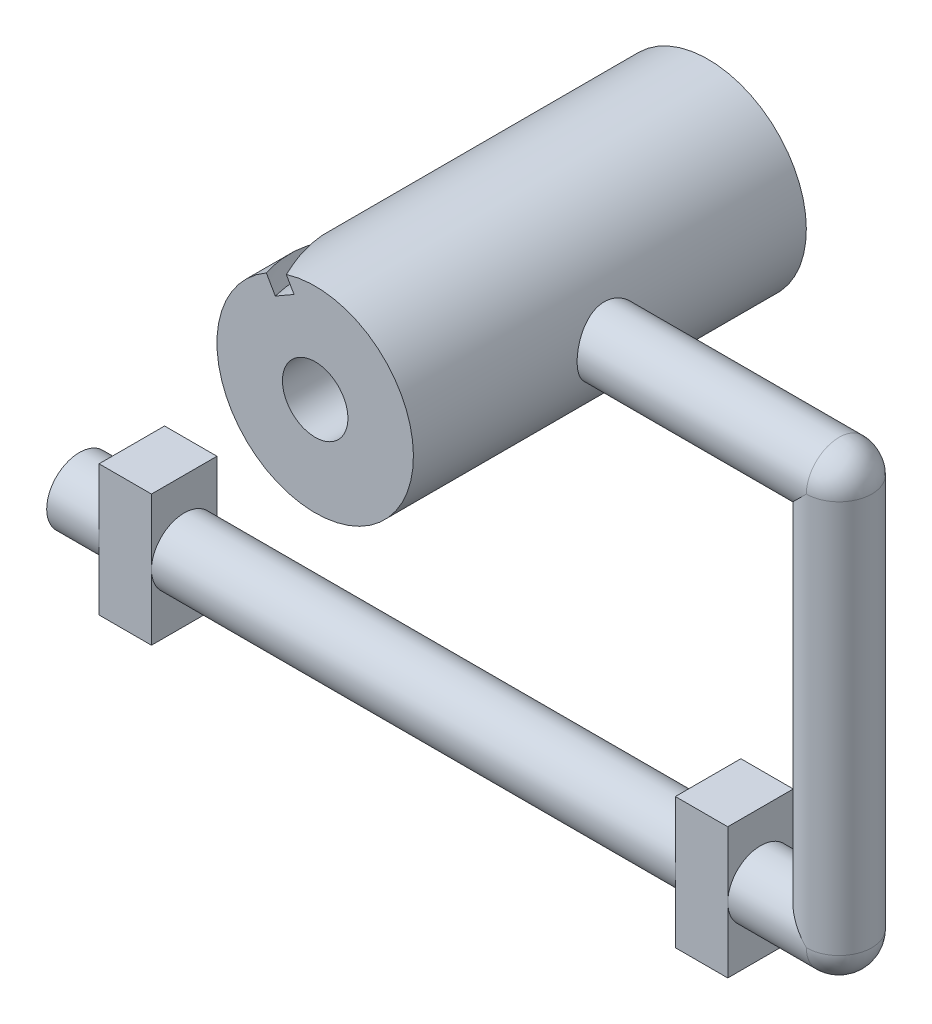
ISO-10303-21;
HEADER;
FILE_DESCRIPTION(('STEP AP214'),'2;1');
FILE_NAME('part.step','',(''),(''),'','','');
FILE_SCHEMA(('AUTOMOTIVE_DESIGN { 1 0 10303 214 1 1 1 1 }'));
ENDSEC;
DATA;
#1=APPLICATION_CONTEXT('core data for automotive mechanical design processes');
#2=APPLICATION_PROTOCOL_DEFINITION('international standard','automotive_design',2000,#1);
#3=PRODUCT_CONTEXT('',#1,'mechanical');
#4=PRODUCT('Part','Part','',(#3));
#5=PRODUCT_RELATED_PRODUCT_CATEGORY('part','',(#4));
#6=PRODUCT_DEFINITION_FORMATION('','',#4);
#7=PRODUCT_DEFINITION_CONTEXT('part definition',#1,'design');
#8=PRODUCT_DEFINITION('design','',#6,#7);
#9=PRODUCT_DEFINITION_SHAPE('','',#8);
#10=(LENGTH_UNIT() NAMED_UNIT(*) SI_UNIT(.MILLI.,.METRE.));
#11=(NAMED_UNIT(*) PLANE_ANGLE_UNIT() SI_UNIT($,.RADIAN.));
#12=(NAMED_UNIT(*) SI_UNIT($,.STERADIAN.) SOLID_ANGLE_UNIT());
#13=UNCERTAINTY_MEASURE_WITH_UNIT(LENGTH_MEASURE(1.E-05),#10,'distance_accuracy_value','');
#14=(GEOMETRIC_REPRESENTATION_CONTEXT(3) GLOBAL_UNCERTAINTY_ASSIGNED_CONTEXT((#13)) GLOBAL_UNIT_ASSIGNED_CONTEXT((#10,
#11,#12)) REPRESENTATION_CONTEXT('',''));
#15=CARTESIAN_POINT('',(0.,0.,0.));
#16=DIRECTION('',(0.,0.,1.));
#17=DIRECTION('',(1.,0.,0.));
#18=AXIS2_PLACEMENT_3D('',#15,#16,#17);
#19=CARTESIAN_POINT('',(0.,0.,15.));
#20=DIRECTION('',(0.,0.,-1.));
#21=DIRECTION('',(-1.,0.,0.));
#22=AXIS2_PLACEMENT_3D('',#19,#20,#21);
#23=CYLINDRICAL_SURFACE('',#22,7.5);
#24=CARTESIAN_POINT('',(7.5,0.,2.5));
#25=CARTESIAN_POINT('',(7.5000003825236,-0.136408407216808,2.5000006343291));
#26=CARTESIAN_POINT('',(7.49624423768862,-0.272812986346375,2.48879933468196));
#27=CARTESIAN_POINT('',(7.48163025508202,-0.54160440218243,2.44442722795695));
#28=CARTESIAN_POINT('',(7.47077168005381,-0.673990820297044,2.41125414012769));
#29=CARTESIAN_POINT('',(7.44313269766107,-0.93083197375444,2.32420189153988));
#30=CARTESIAN_POINT('',(7.42636219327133,-1.05529956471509,2.27035734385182));
#31=CARTESIAN_POINT('',(7.38861114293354,-1.29343734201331,2.14364706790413));
#32=CARTESIAN_POINT('',(7.36762976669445,-1.40710539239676,2.0707775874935));
#33=CARTESIAN_POINT('',(7.32285236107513,-1.62435418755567,1.90543548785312));
#34=CARTESIAN_POINT('',(7.29898891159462,-1.72750925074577,1.81242191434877));
#35=CARTESIAN_POINT('',(7.25150786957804,-1.91708173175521,1.61058211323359));
#36=CARTESIAN_POINT('',(7.22789033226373,-2.00349546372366,1.50175241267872));
#37=CARTESIAN_POINT('',(7.18283331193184,-2.15956235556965,1.26753721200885));
#38=CARTESIAN_POINT('',(7.1614759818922,-2.22866214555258,1.14176565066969));
#39=CARTESIAN_POINT('',(7.12438263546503,-2.3445471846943,0.879559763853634));
#40=CARTESIAN_POINT('',(7.10864490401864,-2.39133924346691,0.743128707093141));
#41=CARTESIAN_POINT('',(7.08528258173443,-2.45968365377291,0.468316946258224));
#42=CARTESIAN_POINT('',(7.07740239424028,-2.48203362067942,0.330156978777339));
#43=CARTESIAN_POINT('',(7.06989141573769,-2.50335280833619,0.0518406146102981));
#44=CARTESIAN_POINT('',(7.07025807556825,-2.5023292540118,-0.0883151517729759));
#45=CARTESIAN_POINT('',(7.0789753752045,-2.47754975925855,-0.359841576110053));
#46=CARTESIAN_POINT('',(7.08696039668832,-2.45483478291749,-0.491321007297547));
#47=CARTESIAN_POINT('',(7.10941644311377,-2.38901540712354,-0.748483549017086));
#48=CARTESIAN_POINT('',(7.12388824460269,-2.34590856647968,-0.874165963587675));
#49=CARTESIAN_POINT('',(7.15794777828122,-2.23984764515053,-1.1185318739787));
#50=CARTESIAN_POINT('',(7.17761414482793,-2.17658512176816,-1.23707006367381));
#51=CARTESIAN_POINT('',(7.21981396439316,-2.03222276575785,-1.46217727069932));
#52=CARTESIAN_POINT('',(7.24234824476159,-1.95111778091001,-1.56874281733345));
#53=CARTESIAN_POINT('',(7.28918322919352,-1.76837333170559,-1.77272899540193));
#54=CARTESIAN_POINT('',(7.31351473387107,-1.66588287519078,-1.86938173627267));
#55=CARTESIAN_POINT('',(7.36017345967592,-1.44584892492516,-2.04432816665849));
#56=CARTESIAN_POINT('',(7.38250048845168,-1.32830398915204,-2.12262009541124));
#57=CARTESIAN_POINT('',(7.42292769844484,-1.07986903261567,-2.25924075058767));
#58=CARTESIAN_POINT('',(7.44098375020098,-0.948858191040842,-2.31736372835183));
#59=CARTESIAN_POINT('',(7.47051417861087,-0.678172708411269,-2.41050793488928));
#60=CARTESIAN_POINT('',(7.48199084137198,-0.538501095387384,-2.44553718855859));
#61=CARTESIAN_POINT('',(7.49669067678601,-0.26095957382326,-2.4901391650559));
#62=CARTESIAN_POINT('',(7.5002500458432,-0.123273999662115,-2.50074952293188));
#63=CARTESIAN_POINT('',(7.49972256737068,0.151937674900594,-2.49916831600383));
#64=CARTESIAN_POINT('',(7.49563701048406,0.289463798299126,-2.48698060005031));
#65=CARTESIAN_POINT('',(7.48050061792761,0.556299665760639,-2.4409702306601));
#66=CARTESIAN_POINT('',(7.46965496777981,0.685732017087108,-2.40778448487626));
#67=CARTESIAN_POINT('',(7.44229617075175,0.937139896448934,-2.32151638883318));
#68=CARTESIAN_POINT('',(7.42578230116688,1.05911447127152,-2.26843150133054));
#69=CARTESIAN_POINT('',(7.38822328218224,1.29572074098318,-2.14232392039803));
#70=CARTESIAN_POINT('',(7.36707036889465,1.41007489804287,-2.06881351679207));
#71=CARTESIAN_POINT('',(7.32263134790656,1.62516207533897,-1.90451462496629));
#72=CARTESIAN_POINT('',(7.29934458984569,1.72589091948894,-1.81372085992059));
#73=CARTESIAN_POINT('',(7.25192119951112,1.91563126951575,-1.61255312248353));
#74=CARTESIAN_POINT('',(7.2277940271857,2.00390242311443,-1.50147693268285));
#75=CARTESIAN_POINT('',(7.18249933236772,2.16064380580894,-1.26557108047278));
#76=CARTESIAN_POINT('',(7.16133183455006,2.22911386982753,-1.14074130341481));
#77=CARTESIAN_POINT('',(7.12455979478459,2.3439923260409,-0.880817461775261));
#78=CARTESIAN_POINT('',(7.10894401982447,2.39044533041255,-0.745744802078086));
#79=CARTESIAN_POINT('',(7.08527080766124,2.45973666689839,-0.469053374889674));
#80=CARTESIAN_POINT('',(7.07720996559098,2.48258563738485,-0.327437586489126));
#81=CARTESIAN_POINT('',(7.06994647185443,2.50319070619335,-0.0495072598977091));
#82=CARTESIAN_POINT('',(7.07031000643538,2.502175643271,0.0867058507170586));
#83=CARTESIAN_POINT('',(7.07878174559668,2.47810573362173,0.356912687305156));
#84=CARTESIAN_POINT('',(7.08688948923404,2.45505219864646,0.490906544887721));
#85=CARTESIAN_POINT('',(7.10961310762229,2.38842953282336,0.75033915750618));
#86=CARTESIAN_POINT('',(7.12410245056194,2.34525836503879,0.875892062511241));
#87=CARTESIAN_POINT('',(7.15790997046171,2.23994841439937,1.11806851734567));
#88=CARTESIAN_POINT('',(7.17722921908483,2.17780542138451,1.23469007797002));
#89=CARTESIAN_POINT('',(7.21957073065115,2.03315173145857,1.46120917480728));
#90=CARTESIAN_POINT('',(7.24271779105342,1.94987060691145,1.57059125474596));
#91=CARTESIAN_POINT('',(7.28958390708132,1.76660720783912,1.7742245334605));
#92=CARTESIAN_POINT('',(7.31330312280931,1.6666202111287,1.86847143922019));
#93=CARTESIAN_POINT('',(7.3597507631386,1.44810389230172,2.04286103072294));
#94=CARTESIAN_POINT('',(7.38240454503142,1.32900378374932,2.1223108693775));
#95=CARTESIAN_POINT('',(7.4231497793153,1.07839339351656,2.25997607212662));
#96=CARTESIAN_POINT('',(7.44124239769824,0.946886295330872,2.31819686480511));
#97=CARTESIAN_POINT('',(7.47013787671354,0.68123411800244,2.40930408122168));
#98=CARTESIAN_POINT('',(7.48123031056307,0.547469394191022,2.44320616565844));
#99=CARTESIAN_POINT('',(7.49616017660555,0.275801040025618,2.48855070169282));
#100=CARTESIAN_POINT('',(7.49999961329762,0.137898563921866,2.49999935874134));
#101=CARTESIAN_POINT('',(7.5,0.,2.5));
#102=B_SPLINE_CURVE_WITH_KNOTS('',3,(#24,#25,#26,#27,#28,#29,#30,#31,#32,#33,#34,#35,#36,#37,
#38,#39,#40,#41,#42,#43,#44,#45,#46,#47,#48,#49,#50,#51,#52,#53,#54,#55,#56,#57,#58,#59,#60,#61,
#62,#63,#64,#65,#66,#67,#68,#69,#70,#71,#72,#73,#74,#75,#76,#77,#78,#79,#80,#81,#82,#83,#84,#85,
#86,#87,#88,#89,#90,#91,#92,#93,#94,#95,#96,#97,#98,#99,#100,#101),.UNSPECIFIED.,.T.,.F.,(4,2,2,
2,2,2,2,2,2,2,2,2,2,2,2,2,2,2,2,2,2,2,2,2,2,2,2,2,2,2,2,2,2,2,2,2,2,2,4),(0.,0.408717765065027,
0.817477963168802,1.22555668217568,1.63371594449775,2.0546171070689,2.47561083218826,
2.90870962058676,3.34167611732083,3.760048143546,4.17829084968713,4.57742066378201,
4.97659827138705,5.38220427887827,5.78792756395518,6.21483264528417,6.64177864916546,
7.07296014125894,7.50399172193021,7.91633957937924,8.32861782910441,8.72895394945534,
9.1293411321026,9.54025999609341,9.95130452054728,10.3810255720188,10.8107502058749,
11.2396003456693,11.668257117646,12.0748916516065,12.4815019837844,12.8803896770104,
13.2793659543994,13.6957516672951,14.1122552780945,14.5449915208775,14.9776170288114,
15.3909139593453,15.8040966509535),.UNSPECIFIED.);
#103=CARTESIAN_POINT('',(7.5,0.,2.5));
#104=VERTEX_POINT('',#103);
#105=EDGE_CURVE('E317',#104,#104,#102,.T.);
#106=ORIENTED_EDGE('',*,*,#105,.F.);
#107=EDGE_LOOP('',(#106));
#108=FACE_BOUND('',#107,.T.);
#109=CARTESIAN_POINT('',(-2.06728016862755,-7.20946271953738,-15.));
#110=CARTESIAN_POINT('',(-3.71279298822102,-6.73761951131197,-12.125));
#111=CARTESIAN_POINT('',(-4.990623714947,-5.59854221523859,-9.25000000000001));
#112=CARTESIAN_POINT('',(-6.26845444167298,-4.45946491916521,-6.37500000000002));
#113=CARTESIAN_POINT('',(-6.92551302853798,-2.87876176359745,-3.50000000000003));
#114=CARTESIAN_POINT('',(-7.58257161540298,-1.29805860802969,-0.625000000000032));
#115=CARTESIAN_POINT('',(-7.48871955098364,0.411192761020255,2.24999999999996));
#116=CARTESIAN_POINT('',(-7.39486748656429,2.1204441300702,5.12499999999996));
#117=CARTESIAN_POINT('',(-6.5686933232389,3.61970551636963,7.99999999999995));
#118=CARTESIAN_POINT('',(-5.7425191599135,5.11896690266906,10.8749999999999));
#119=CARTESIAN_POINT('',(-4.34765682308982,6.11129120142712,13.7499999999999));
#120=CARTESIAN_POINT('',(-2.95279448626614,7.10361550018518,16.6249999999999));
#121=CARTESIAN_POINT('',(-1.26551356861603,7.39246071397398,19.4999999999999));
#122=CARTESIAN_POINT('',(0.421767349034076,7.68130592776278,22.3749999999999));
#123=CARTESIAN_POINT('',(2.06728016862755,7.20946271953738,25.2499999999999));
#124=CARTESIAN_POINT('',(3.71279298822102,6.73761951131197,28.1249999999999));
#125=CARTESIAN_POINT('',(4.990623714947,5.59854221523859,30.9999999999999));
#126=(BOUNDED_CURVE() B_SPLINE_CURVE(2,(#109,#110,#111,#112,#113,#114,#115,#116,#117,#118,#119,
#120,#121,#122,#123,#124,#125),.UNSPECIFIED.,.F.,.F.) B_SPLINE_CURVE_WITH_KNOTS((3,2,2,2,2,2,2,
2,3),(0.,0.125,0.25,0.375,0.5,0.625,0.75,0.875,1.),
.UNSPECIFIED.) CURVE() GEOMETRIC_REPRESENTATION_ITEM() RATIONAL_B_SPLINE_CURVE((1.,
0.974927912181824,1.,0.974927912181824,1.,0.974927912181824,1.,0.974927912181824,1.,
0.974927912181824,1.,0.974927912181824,1.,0.974927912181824,1.,0.974927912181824,1.)) REPRESENTATION_ITEM(''));
#127=CARTESIAN_POINT('',(-2.06728016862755,-7.20946271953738,-15.));
#128=VERTEX_POINT('',#127);
#129=CARTESIAN_POINT('',(-3.72694224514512,6.50844847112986,15.));
#130=VERTEX_POINT('',#129);
#131=EDGE_CURVE('E185',#128,#130,#126,.T.);
#132=ORIENTED_EDGE('',*,*,#131,.F.);
#133=CARTESIAN_POINT('',(0.,0.,-15.));
#134=DIRECTION('',(0.,0.,1.));
#135=DIRECTION('',(1.,0.,0.));
#136=AXIS2_PLACEMENT_3D('',#133,#134,#135);
#137=CIRCLE('',#136,7.5);
#138=CARTESIAN_POINT('',(-3.60148470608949,-6.57870108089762,-15.));
#139=VERTEX_POINT('',#138);
#140=EDGE_CURVE('E332',#128,#139,#137,.T.);
#141=ORIENTED_EDGE('',*,*,#140,.T.);
#142=CARTESIAN_POINT('',(-3.60148470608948,-6.57870108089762,-15.));
#143=CARTESIAN_POINT('',(-5.10303029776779,-5.75668569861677,-12.125));
#144=CARTESIAN_POINT('',(-6.0992170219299,-4.36457921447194,-9.25000000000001));
#145=CARTESIAN_POINT('',(-7.095403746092,-2.97247273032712,-6.37500000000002));
#146=CARTESIAN_POINT('',(-7.38892460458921,-1.28599890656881,-3.50000000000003));
#147=CARTESIAN_POINT('',(-7.68244546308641,0.400474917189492,-0.625000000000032));
#148=CARTESIAN_POINT('',(-7.21516505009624,2.04728925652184,2.24999999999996));
#149=CARTESIAN_POINT('',(-6.74788463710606,3.69410359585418,5.12499999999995));
#150=CARTESIAN_POINT('',(-5.61235356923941,4.97508667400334,7.99999999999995));
#151=CARTESIAN_POINT('',(-4.47682250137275,6.2560697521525,10.8749999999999));
#152=CARTESIAN_POINT('',(-2.89794663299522,6.91750716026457,13.7499999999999));
#153=CARTESIAN_POINT('',(-1.3190707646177,7.57894456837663,16.6249999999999));
#154=CARTESIAN_POINT('',(0.390434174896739,7.48983051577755,19.4999999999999));
#155=CARTESIAN_POINT('',(2.09993911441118,7.40071646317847,22.3749999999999));
#156=CARTESIAN_POINT('',(3.60148470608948,6.57870108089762,25.2499999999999));
#157=CARTESIAN_POINT('',(5.10303029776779,5.75668569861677,28.1249999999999));
#158=CARTESIAN_POINT('',(6.0992170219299,4.36457921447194,30.9999999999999));
#159=(BOUNDED_CURVE() B_SPLINE_CURVE(2,(#142,#143,#144,#145,#146,#147,#148,#149,#150,#151,#152,
#153,#154,#155,#156,#157,#158),.UNSPECIFIED.,.F.,.F.) B_SPLINE_CURVE_WITH_KNOTS((3,2,2,2,2,2,2,
2,3),(0.,0.125,0.25,0.375,0.5,0.625,0.75,0.875,1.),
.UNSPECIFIED.) CURVE() GEOMETRIC_REPRESENTATION_ITEM() RATIONAL_B_SPLINE_CURVE((1.,
0.974927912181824,1.,0.974927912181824,1.,0.974927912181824,1.,0.974927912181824,1.,
0.974927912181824,1.,0.974927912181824,1.,0.974927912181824,1.,0.974927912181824,1.)) REPRESENTATION_ITEM(''));
#160=CARTESIAN_POINT('',(-2.20511190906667,7.16850622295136,15.));
#161=VERTEX_POINT('',#160);
#162=EDGE_CURVE('E162',#161,#139,#159,.F.);
#163=ORIENTED_EDGE('',*,*,#162,.F.);
#164=CARTESIAN_POINT('',(0.,0.,15.));
#165=DIRECTION('',(0.,0.,1.));
#166=DIRECTION('',(1.,0.,0.));
#167=AXIS2_PLACEMENT_3D('',#164,#165,#166);
#168=CIRCLE('',#167,7.5);
#169=EDGE_CURVE('E324',#130,#161,#168,.T.);
#170=ORIENTED_EDGE('',*,*,#169,.F.);
#171=EDGE_LOOP('',(#132,#141,#163,#170));
#172=FACE_BOUND('',#171,.T.);
#173=ADVANCED_FACE('F32',(#108,#172),#23,.T.);
#174=CARTESIAN_POINT('',(0.,0.,15.));
#175=DIRECTION('',(0.,0.,1.));
#176=DIRECTION('',(1.,0.,0.));
#177=AXIS2_PLACEMENT_3D('',#174,#175,#176);
#178=PLANE('',#177);
#179=CARTESIAN_POINT('',(0.,0.,15.));
#180=DIRECTION('',(0.,0.,1.));
#181=DIRECTION('',(1.,0.,0.));
#182=AXIS2_PLACEMENT_3D('',#179,#180,#181);
#183=CIRCLE('',#182,2.5);
#184=CARTESIAN_POINT('',(2.5,0.,15.));
#185=VERTEX_POINT('',#184);
#186=EDGE_CURVE('E331',#185,#185,#183,.T.);
#187=ORIENTED_EDGE('',*,*,#186,.F.);
#188=EDGE_LOOP('',(#187));
#189=FACE_BOUND('',#188,.T.);
#190=CARTESIAN_POINT('',(-1.61515304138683,6.13824692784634,15.));
#191=CARTESIAN_POINT('',(-1.73744181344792,6.06822053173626,15.));
#192=CARTESIAN_POINT('',(-1.85973058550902,5.99819413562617,15.));
#193=CARTESIAN_POINT('',(-2.10430812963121,5.85814134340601,15.));
#194=CARTESIAN_POINT('',(-2.2265969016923,5.78811494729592,15.));
#195=CARTESIAN_POINT('',(-2.58119907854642,5.58505859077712,15.));
#196=CARTESIAN_POINT('',(-2.81351248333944,5.4520286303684,15.));
#197=CARTESIAN_POINT('',(-3.04582588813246,5.31899866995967,15.));
#198=B_SPLINE_CURVE_WITH_KNOTS('',3,(#190,#191,#192,#193,#194,#195,#196,#197),.UNSPECIFIED.,.F.,
.F.,(4,2,2,4),(0.,0.422757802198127,0.845515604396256,1.6486335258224),.UNSPECIFIED.);
#199=CARTESIAN_POINT('',(-1.61515304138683,6.13824692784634,15.));
#200=VERTEX_POINT('',#199);
#201=CARTESIAN_POINT('',(-3.04582588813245,5.31899866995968,15.));
#202=VERTEX_POINT('',#201);
#203=EDGE_CURVE('E43',#200,#202,#198,.T.);
#204=ORIENTED_EDGE('',*,*,#203,.T.);
#205=CARTESIAN_POINT('',(-3.04582588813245,5.31899866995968,15.));
#206=CARTESIAN_POINT('',(-3.10404526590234,5.42066856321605,15.));
#207=CARTESIAN_POINT('',(-3.16226464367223,5.52233845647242,15.));
#208=CARTESIAN_POINT('',(-3.27870339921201,5.72567824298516,15.));
#209=CARTESIAN_POINT('',(-3.3369227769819,5.82734813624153,15.));
#210=CARTESIAN_POINT('',(-3.5057421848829,6.12216151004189,15.));
#211=CARTESIAN_POINT('',(-3.61634221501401,6.31530499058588,15.));
#212=CARTESIAN_POINT('',(-3.72694224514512,6.50844847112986,15.));
#213=B_SPLINE_CURVE_WITH_KNOTS('',3,(#205,#206,#207,#208,#209,#210,#211,#212),.UNSPECIFIED.,.F.,
.F.,(4,2,2,4),(0.,0.35147740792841,0.702954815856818,1.37066054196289),.UNSPECIFIED.);
#214=EDGE_CURVE('E11',#202,#130,#213,.T.);
#215=ORIENTED_EDGE('',*,*,#214,.T.);
#216=ORIENTED_EDGE('',*,*,#169,.T.);
#217=CARTESIAN_POINT('',(-2.44647249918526,7.59,15.));
#218=CARTESIAN_POINT('',(-2.36817337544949,7.453264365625,15.));
#219=CARTESIAN_POINT('',(-2.28987425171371,7.31652873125,15.));
#220=CARTESIAN_POINT('',(-2.13327600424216,7.04305746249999,15.));
#221=CARTESIAN_POINT('',(-2.05497688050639,6.90632182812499,15.));
#222=CARTESIAN_POINT('',(-1.85616951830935,6.55913977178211,15.));
#223=CARTESIAN_POINT('',(-1.73566127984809,6.34869334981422,15.));
#224=CARTESIAN_POINT('',(-1.61515304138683,6.13824692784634,15.));
#225=B_SPLINE_CURVE_WITH_KNOTS('',3,(#217,#218,#219,#220,#221,#222,#223,#224),.UNSPECIFIED.,.F.,
.F.,(4,2,2,4),(0.,0.472701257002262,0.945402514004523,1.67292528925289),.UNSPECIFIED.);
#226=EDGE_CURVE('E199',#161,#200,#225,.T.);
#227=ORIENTED_EDGE('',*,*,#226,.T.);
#228=EDGE_LOOP('',(#204,#215,#216,#227));
#229=FACE_BOUND('',#228,.T.);
#230=ADVANCED_FACE('F208',(#189,#229),#178,.T.);
#231=CARTESIAN_POINT('',(0.,0.,-15.));
#232=DIRECTION('',(0.,0.,1.));
#233=DIRECTION('',(1.,0.,0.));
#234=AXIS2_PLACEMENT_3D('',#231,#232,#233);
#235=PLANE('',#234);
#236=CARTESIAN_POINT('',(0.,0.,-15.));
#237=DIRECTION('',(0.,0.,1.));
#238=DIRECTION('',(1.,0.,0.));
#239=AXIS2_PLACEMENT_3D('',#236,#237,#238);
#240=CIRCLE('',#239,2.5);
#241=CARTESIAN_POINT('',(2.5,0.,-15.));
#242=VERTEX_POINT('',#241);
#243=EDGE_CURVE('E327',#242,#242,#240,.T.);
#244=ORIENTED_EDGE('',*,*,#243,.T.);
#245=EDGE_LOOP('',(#244));
#246=FACE_BOUND('',#245,.T.);
#247=DIRECTION('',(0.275637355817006,0.961261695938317,0.));
#248=VECTOR('',#247,1.);
#249=CARTESIAN_POINT('',(-3.27424318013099,-5.43747425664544,-15.));
#250=LINE('',#249,#248);
#251=CARTESIAN_POINT('',(-3.27424318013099,-5.43747425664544,-15.));
#252=VERTEX_POINT('',#251);
#253=EDGE_CURVE('E159',#139,#252,#250,.T.);
#254=ORIENTED_EDGE('',*,*,#253,.F.);
#255=ORIENTED_EDGE('',*,*,#140,.F.);
#256=DIRECTION('',(-0.275637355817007,-0.961261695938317,0.));
#257=VECTOR('',#256,1.);
#258=CARTESIAN_POINT('',(-2.06728016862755,-7.20946271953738,-15.));
#259=LINE('',#258,#257);
#260=CARTESIAN_POINT('',(-1.68947492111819,-5.89189924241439,-15.));
#261=VERTEX_POINT('',#260);
#262=EDGE_CURVE('E176',#261,#128,#259,.T.);
#263=ORIENTED_EDGE('',*,*,#262,.F.);
#264=DIRECTION('',(0.961261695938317,-0.275637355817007,0.));
#265=VECTOR('',#264,1.);
#266=CARTESIAN_POINT('',(-1.68947492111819,-5.89189924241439,-15.));
#267=LINE('',#266,#265);
#268=EDGE_CURVE('E171',#252,#261,#267,.T.);
#269=ORIENTED_EDGE('',*,*,#268,.F.);
#270=EDGE_LOOP('',(#254,#255,#263,#269));
#271=FACE_BOUND('',#270,.T.);
#272=ADVANCED_FACE('F179',(#246,#271),#235,.F.);
#273=CARTESIAN_POINT('',(-29.,-35.,-2.5));
#274=DIRECTION('',(1.,0.,0.));
#275=DIRECTION('',(0.,0.,-1.));
#276=AXIS2_PLACEMENT_3D('',#273,#274,#275);
#277=PLANE('',#276);
#278=CARTESIAN_POINT('',(-29.,-30.,0.));
#279=DIRECTION('',(-1.,0.,0.));
#280=DIRECTION('',(0.,0.,1.));
#281=AXIS2_PLACEMENT_3D('',#278,#279,#280);
#282=CIRCLE('',#281,2.5);
#283=CARTESIAN_POINT('',(-29.,-30.,2.5));
#284=VERTEX_POINT('',#283);
#285=CARTESIAN_POINT('',(-29.,-30.,-2.5));
#286=VERTEX_POINT('',#285);
#287=EDGE_CURVE('E330',#284,#286,#282,.T.);
#288=ORIENTED_EDGE('',*,*,#287,.F.);
#289=DIRECTION('',(0.,1.,0.));
#290=VECTOR('',#289,1.);
#291=CARTESIAN_POINT('',(-29.,-35.,2.5));
#292=LINE('',#291,#290);
#293=CARTESIAN_POINT('',(-29.,-25.,2.5));
#294=VERTEX_POINT('',#293);
#295=EDGE_CURVE('E418',#284,#294,#292,.T.);
#296=ORIENTED_EDGE('',*,*,#295,.T.);
#297=DIRECTION('',(0.,0.,-1.));
#298=VECTOR('',#297,1.);
#299=CARTESIAN_POINT('',(-29.,-25.,2.5));
#300=LINE('',#299,#298);
#301=CARTESIAN_POINT('',(-29.,-25.,-2.5));
#302=VERTEX_POINT('',#301);
#303=EDGE_CURVE('E414',#294,#302,#300,.T.);
#304=ORIENTED_EDGE('',*,*,#303,.T.);
#305=DIRECTION('',(0.,-1.,0.));
#306=VECTOR('',#305,1.);
#307=CARTESIAN_POINT('',(-29.,-25.,-2.5));
#308=LINE('',#307,#306);
#309=EDGE_CURVE('E410',#302,#286,#308,.T.);
#310=ORIENTED_EDGE('',*,*,#309,.T.);
#311=EDGE_LOOP('',(#288,#296,#304,#310));
#312=FACE_BOUND('',#311,.T.);
#313=ADVANCED_FACE('F254',(#312),#277,.F.);
#314=EDGE_CURVE('E59',#286,#284,#282,.T.);
#315=ORIENTED_EDGE('',*,*,#314,.F.);
#316=CARTESIAN_POINT('',(-29.,-35.,-2.5));
#317=VERTEX_POINT('',#316);
#318=EDGE_CURVE('E413',#286,#317,#308,.T.);
#319=ORIENTED_EDGE('',*,*,#318,.T.);
#320=DIRECTION('',(0.,0.,1.));
#321=VECTOR('',#320,1.);
#322=CARTESIAN_POINT('',(-29.,-35.,-2.5));
#323=LINE('',#322,#321);
#324=CARTESIAN_POINT('',(-29.,-35.,2.5));
#325=VERTEX_POINT('',#324);
#326=EDGE_CURVE('E419',#317,#325,#323,.T.);
#327=ORIENTED_EDGE('',*,*,#326,.T.);
#328=EDGE_CURVE('E416',#325,#284,#292,.T.);
#329=ORIENTED_EDGE('',*,*,#328,.T.);
#330=EDGE_LOOP('',(#315,#319,#327,#329));
#331=FACE_BOUND('',#330,.T.);
#332=ADVANCED_FACE('F257',(#331),#277,.F.);
#333=CARTESIAN_POINT('',(15.,-35.,-2.5));
#334=DIRECTION('',(-1.,0.,0.));
#335=DIRECTION('',(0.,0.,1.));
#336=AXIS2_PLACEMENT_3D('',#333,#334,#335);
#337=PLANE('',#336);
#338=CARTESIAN_POINT('',(15.,-30.,0.));
#339=DIRECTION('',(-1.,0.,0.));
#340=DIRECTION('',(0.,0.,1.));
#341=AXIS2_PLACEMENT_3D('',#338,#339,#340);
#342=CIRCLE('',#341,2.5);
#343=CARTESIAN_POINT('',(15.,-30.,2.5));
#344=VERTEX_POINT('',#343);
#345=CARTESIAN_POINT('',(15.,-30.,-2.5));
#346=VERTEX_POINT('',#345);
#347=EDGE_CURVE('E395',#344,#346,#342,.T.);
#348=ORIENTED_EDGE('',*,*,#347,.F.);
#349=DIRECTION('',(0.,1.,0.));
#350=VECTOR('',#349,1.);
#351=CARTESIAN_POINT('',(15.,-25.,2.5));
#352=LINE('',#351,#350);
#353=CARTESIAN_POINT('',(15.,-25.,2.5));
#354=VERTEX_POINT('',#353);
#355=EDGE_CURVE('E373',#344,#354,#352,.T.);
#356=ORIENTED_EDGE('',*,*,#355,.T.);
#357=DIRECTION('',(0.,0.,-1.));
#358=VECTOR('',#357,1.);
#359=CARTESIAN_POINT('',(15.,-25.,-2.5));
#360=LINE('',#359,#358);
#361=CARTESIAN_POINT('',(15.,-25.,-2.5));
#362=VERTEX_POINT('',#361);
#363=EDGE_CURVE('E369',#354,#362,#360,.T.);
#364=ORIENTED_EDGE('',*,*,#363,.T.);
#365=DIRECTION('',(0.,-1.,0.));
#366=VECTOR('',#365,1.);
#367=CARTESIAN_POINT('',(15.,-25.,-2.5));
#368=LINE('',#367,#366);
#369=EDGE_CURVE('E376',#362,#346,#368,.T.);
#370=ORIENTED_EDGE('',*,*,#369,.T.);
#371=EDGE_LOOP('',(#348,#356,#364,#370));
#372=FACE_BOUND('',#371,.T.);
#373=ADVANCED_FACE('F288',(#372),#337,.T.);
#374=CARTESIAN_POINT('',(25.,0.,0.));
#375=DIRECTION('',(-1.,0.,0.));
#376=DIRECTION('',(0.,0.,1.));
#377=AXIS2_PLACEMENT_3D('',#374,#375,#376);
#378=CYLINDRICAL_SURFACE('',#377,2.5);
#379=CARTESIAN_POINT('',(25.,0.,0.));
#380=DIRECTION('',(1.,0.,0.));
#381=DIRECTION('',(0.,0.,-1.));
#382=AXIS2_PLACEMENT_3D('',#379,#380,#381);
#383=CIRCLE('',#382,2.5);
#384=CARTESIAN_POINT('',(25.,0.,-2.5));
#385=VERTEX_POINT('',#384);
#386=CARTESIAN_POINT('',(25.,0.,2.5));
#387=VERTEX_POINT('',#386);
#388=EDGE_CURVE('E334',#385,#387,#383,.T.);
#389=ORIENTED_EDGE('',*,*,#388,.F.);
#390=CARTESIAN_POINT('',(25.,0.,0.));
#391=DIRECTION('',(-0.707106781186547,0.707106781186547,0.));
#392=DIRECTION('',(-0.707106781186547,-0.707106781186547,0.));
#393=AXIS2_PLACEMENT_3D('',#390,#391,#392);
#394=ELLIPSE('',#393,3.53553390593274,2.5);
#395=EDGE_CURVE('E340',#385,#387,#394,.T.);
#396=ORIENTED_EDGE('',*,*,#395,.T.);
#397=EDGE_LOOP('',(#389,#396));
#398=FACE_BOUND('',#397,.T.);
#399=ORIENTED_EDGE('',*,*,#105,.T.);
#400=EDGE_LOOP('',(#399));
#401=FACE_BOUND('',#400,.T.);
#402=ADVANCED_FACE('F311',(#398,#401),#378,.T.);
#403=CARTESIAN_POINT('',(25.,-30.,0.));
#404=DIRECTION('',(0.,1.,0.));
#405=DIRECTION('',(0.,0.,1.));
#406=AXIS2_PLACEMENT_3D('',#403,#404,#405);
#407=CYLINDRICAL_SURFACE('',#406,2.5);
#408=CARTESIAN_POINT('',(25.,-30.,0.));
#409=DIRECTION('',(0.707106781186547,0.707106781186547,0.));
#410=DIRECTION('',(-0.707106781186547,0.707106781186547,0.));
#411=AXIS2_PLACEMENT_3D('',#408,#409,#410);
#412=ELLIPSE('',#411,3.53553390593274,2.5);
#413=CARTESIAN_POINT('',(25.,-30.,2.5));
#414=VERTEX_POINT('',#413);
#415=CARTESIAN_POINT('',(25.,-30.,-2.5));
#416=VERTEX_POINT('',#415);
#417=EDGE_CURVE('E347',#414,#416,#412,.F.);
#418=ORIENTED_EDGE('',*,*,#417,.F.);
#419=CARTESIAN_POINT('',(25.,-30.,0.));
#420=DIRECTION('',(0.,1.,0.));
#421=DIRECTION('',(0.,0.,1.));
#422=AXIS2_PLACEMENT_3D('',#419,#420,#421);
#423=CIRCLE('',#422,2.5);
#424=EDGE_CURVE('E342',#414,#416,#423,.T.);
#425=ORIENTED_EDGE('',*,*,#424,.T.);
#426=EDGE_LOOP('',(#418,#425));
#427=FACE_BOUND('',#426,.T.);
#428=ORIENTED_EDGE('',*,*,#395,.F.);
#429=CARTESIAN_POINT('',(25.,0.,0.));
#430=DIRECTION('',(0.,1.,0.));
#431=DIRECTION('',(0.,0.,1.));
#432=AXIS2_PLACEMENT_3D('',#429,#430,#431);
#433=CIRCLE('',#432,2.5);
#434=EDGE_CURVE('E344',#387,#385,#433,.T.);
#435=ORIENTED_EDGE('',*,*,#434,.F.);
#436=EDGE_LOOP('',(#428,#435));
#437=FACE_BOUND('',#436,.T.);
#438=ADVANCED_FACE('F307',(#427,#437),#407,.T.);
#439=CARTESIAN_POINT('',(19.,-30.,0.));
#440=DIRECTION('',(1.,0.,0.));
#441=DIRECTION('',(0.,0.,-1.));
#442=AXIS2_PLACEMENT_3D('',#439,#440,#441);
#443=CYLINDRICAL_SURFACE('',#442,2.5);
#444=CARTESIAN_POINT('',(19.,-30.,0.));
#445=DIRECTION('',(1.,0.,0.));
#446=DIRECTION('',(0.,0.,-1.));
#447=AXIS2_PLACEMENT_3D('',#444,#445,#446);
#448=CIRCLE('',#447,2.5);
#449=CARTESIAN_POINT('',(19.,-30.,-2.5));
#450=VERTEX_POINT('',#449);
#451=CARTESIAN_POINT('',(19.,-30.,2.5));
#452=VERTEX_POINT('',#451);
#453=EDGE_CURVE('E350',#450,#452,#448,.T.);
#454=ORIENTED_EDGE('',*,*,#453,.T.);
#455=EDGE_CURVE('E353',#452,#450,#448,.T.);
#456=ORIENTED_EDGE('',*,*,#455,.T.);
#457=EDGE_LOOP('',(#454,#456));
#458=FACE_BOUND('',#457,.T.);
#459=CARTESIAN_POINT('',(25.,-30.,0.));
#460=DIRECTION('',(1.,0.,0.));
#461=DIRECTION('',(0.,0.,-1.));
#462=AXIS2_PLACEMENT_3D('',#459,#460,#461);
#463=CIRCLE('',#462,2.5);
#464=EDGE_CURVE('E354',#414,#416,#463,.T.);
#465=ORIENTED_EDGE('',*,*,#464,.F.);
#466=ORIENTED_EDGE('',*,*,#417,.T.);
#467=EDGE_LOOP('',(#465,#466));
#468=FACE_BOUND('',#467,.T.);
#469=ADVANCED_FACE('F304',(#458,#468),#443,.T.);
#470=CARTESIAN_POINT('',(19.,-35.,-2.5));
#471=DIRECTION('',(-1.,0.,0.));
#472=DIRECTION('',(0.,0.,1.));
#473=AXIS2_PLACEMENT_3D('',#470,#471,#472);
#474=PLANE('',#473);
#475=ORIENTED_EDGE('',*,*,#453,.F.);
#476=DIRECTION('',(0.,-1.,0.));
#477=VECTOR('',#476,1.);
#478=CARTESIAN_POINT('',(19.,-25.,-2.5));
#479=LINE('',#478,#477);
#480=CARTESIAN_POINT('',(19.,-25.,-2.5));
#481=VERTEX_POINT('',#480);
#482=EDGE_CURVE('E388',#481,#450,#479,.T.);
#483=ORIENTED_EDGE('',*,*,#482,.F.);
#484=DIRECTION('',(0.,0.,-1.));
#485=VECTOR('',#484,1.);
#486=CARTESIAN_POINT('',(19.,-25.,-2.5));
#487=LINE('',#486,#485);
#488=CARTESIAN_POINT('',(19.,-25.,2.5));
#489=VERTEX_POINT('',#488);
#490=EDGE_CURVE('E380',#489,#481,#487,.T.);
#491=ORIENTED_EDGE('',*,*,#490,.F.);
#492=DIRECTION('',(0.,1.,0.));
#493=VECTOR('',#492,1.);
#494=CARTESIAN_POINT('',(19.,-25.,2.5));
#495=LINE('',#494,#493);
#496=EDGE_CURVE('E385',#452,#489,#495,.T.);
#497=ORIENTED_EDGE('',*,*,#496,.F.);
#498=EDGE_LOOP('',(#475,#483,#491,#497));
#499=FACE_BOUND('',#498,.T.);
#500=ADVANCED_FACE('F283',(#499),#474,.F.);
#501=CARTESIAN_POINT('',(15.,-25.,-2.5));
#502=DIRECTION('',(0.,0.,1.));
#503=DIRECTION('',(0.,-1.,0.));
#504=AXIS2_PLACEMENT_3D('',#501,#502,#503);
#505=PLANE('',#504);
#506=ORIENTED_EDGE('',*,*,#482,.T.);
#507=CARTESIAN_POINT('',(19.,-35.,-2.5));
#508=VERTEX_POINT('',#507);
#509=EDGE_CURVE('E390',#450,#508,#479,.T.);
#510=ORIENTED_EDGE('',*,*,#509,.T.);
#511=DIRECTION('',(1.,0.,0.));
#512=VECTOR('',#511,1.);
#513=CARTESIAN_POINT('',(15.,-35.,-2.5));
#514=LINE('',#513,#512);
#515=CARTESIAN_POINT('',(15.,-35.,-2.5));
#516=VERTEX_POINT('',#515);
#517=EDGE_CURVE('E357',#516,#508,#514,.T.);
#518=ORIENTED_EDGE('',*,*,#517,.F.);
#519=EDGE_CURVE('E379',#346,#516,#368,.T.);
#520=ORIENTED_EDGE('',*,*,#519,.F.);
#521=ORIENTED_EDGE('',*,*,#369,.F.);
#522=DIRECTION('',(1.,0.,0.));
#523=VECTOR('',#522,1.);
#524=CARTESIAN_POINT('',(15.,-25.,-2.5));
#525=LINE('',#524,#523);
#526=EDGE_CURVE('E366',#362,#481,#525,.T.);
#527=ORIENTED_EDGE('',*,*,#526,.T.);
#528=EDGE_LOOP('',(#506,#510,#518,#520,#521,#527));
#529=FACE_BOUND('',#528,.T.);
#530=ADVANCED_FACE('F299',(#529),#505,.F.);
#531=CARTESIAN_POINT('',(15.,-35.,-2.5));
#532=DIRECTION('',(0.,1.,0.));
#533=DIRECTION('',(0.,0.,1.));
#534=AXIS2_PLACEMENT_3D('',#531,#532,#533);
#535=PLANE('',#534);
#536=DIRECTION('',(0.,0.,1.));
#537=VECTOR('',#536,1.);
#538=CARTESIAN_POINT('',(19.,-35.,-2.5));
#539=LINE('',#538,#537);
#540=CARTESIAN_POINT('',(19.,-35.,2.5));
#541=VERTEX_POINT('',#540);
#542=EDGE_CURVE('E386',#508,#541,#539,.T.);
#543=ORIENTED_EDGE('',*,*,#542,.T.);
#544=DIRECTION('',(1.,0.,0.));
#545=VECTOR('',#544,1.);
#546=CARTESIAN_POINT('',(15.,-35.,2.5));
#547=LINE('',#546,#545);
#548=CARTESIAN_POINT('',(15.,-35.,2.5));
#549=VERTEX_POINT('',#548);
#550=EDGE_CURVE('E360',#549,#541,#547,.T.);
#551=ORIENTED_EDGE('',*,*,#550,.F.);
#552=DIRECTION('',(0.,0.,1.));
#553=VECTOR('',#552,1.);
#554=CARTESIAN_POINT('',(15.,-35.,-2.5));
#555=LINE('',#554,#553);
#556=EDGE_CURVE('E374',#516,#549,#555,.T.);
#557=ORIENTED_EDGE('',*,*,#556,.F.);
#558=ORIENTED_EDGE('',*,*,#517,.T.);
#559=EDGE_LOOP('',(#543,#551,#557,#558));
#560=FACE_BOUND('',#559,.T.);
#561=ADVANCED_FACE('F295',(#560),#535,.F.);
#562=CARTESIAN_POINT('',(15.,-25.,2.5));
#563=DIRECTION('',(0.,0.,-1.));
#564=DIRECTION('',(0.,1.,0.));
#565=AXIS2_PLACEMENT_3D('',#562,#563,#564);
#566=PLANE('',#565);
#567=EDGE_CURVE('E382',#541,#452,#495,.T.);
#568=ORIENTED_EDGE('',*,*,#567,.T.);
#569=ORIENTED_EDGE('',*,*,#496,.T.);
#570=DIRECTION('',(1.,0.,0.));
#571=VECTOR('',#570,1.);
#572=CARTESIAN_POINT('',(15.,-25.,2.5));
#573=LINE('',#572,#571);
#574=EDGE_CURVE('E363',#354,#489,#573,.T.);
#575=ORIENTED_EDGE('',*,*,#574,.F.);
#576=ORIENTED_EDGE('',*,*,#355,.F.);
#577=EDGE_CURVE('E371',#549,#344,#352,.T.);
#578=ORIENTED_EDGE('',*,*,#577,.F.);
#579=ORIENTED_EDGE('',*,*,#550,.T.);
#580=EDGE_LOOP('',(#568,#569,#575,#576,#578,#579));
#581=FACE_BOUND('',#580,.T.);
#582=ADVANCED_FACE('F291',(#581),#566,.F.);
#583=CARTESIAN_POINT('',(15.,-25.,-2.5));
#584=DIRECTION('',(0.,-1.,0.));
#585=DIRECTION('',(0.,0.,-1.));
#586=AXIS2_PLACEMENT_3D('',#583,#584,#585);
#587=PLANE('',#586);
#588=ORIENTED_EDGE('',*,*,#490,.T.);
#589=ORIENTED_EDGE('',*,*,#526,.F.);
#590=ORIENTED_EDGE('',*,*,#363,.F.);
#591=ORIENTED_EDGE('',*,*,#574,.T.);
#592=EDGE_LOOP('',(#588,#589,#590,#591));
#593=FACE_BOUND('',#592,.T.);
#594=ADVANCED_FACE('F286',(#593),#587,.F.);
#595=EDGE_CURVE('E323',#346,#344,#342,.T.);
#596=ORIENTED_EDGE('',*,*,#595,.F.);
#597=ORIENTED_EDGE('',*,*,#519,.T.);
#598=ORIENTED_EDGE('',*,*,#556,.T.);
#599=ORIENTED_EDGE('',*,*,#577,.T.);
#600=EDGE_LOOP('',(#596,#597,#598,#599));
#601=FACE_BOUND('',#600,.T.);
#602=ADVANCED_FACE('F281',(#601),#337,.T.);
#603=ORIENTED_EDGE('',*,*,#455,.F.);
#604=ORIENTED_EDGE('',*,*,#567,.F.);
#605=ORIENTED_EDGE('',*,*,#542,.F.);
#606=ORIENTED_EDGE('',*,*,#509,.F.);
#607=EDGE_LOOP('',(#603,#604,#605,#606));
#608=FACE_BOUND('',#607,.T.);
#609=ADVANCED_FACE('F277',(#608),#474,.F.);
#610=CARTESIAN_POINT('',(-25.,-30.,0.));
#611=DIRECTION('',(1.,0.,0.));
#612=DIRECTION('',(0.,0.,-1.));
#613=AXIS2_PLACEMENT_3D('',#610,#611,#612);
#614=CYLINDRICAL_SURFACE('',#613,2.5);
#615=ORIENTED_EDGE('',*,*,#347,.T.);
#616=ORIENTED_EDGE('',*,*,#595,.T.);
#617=EDGE_LOOP('',(#615,#616));
#618=FACE_BOUND('',#617,.T.);
#619=CARTESIAN_POINT('',(-25.,-30.,0.));
#620=DIRECTION('',(-1.,0.,0.));
#621=DIRECTION('',(0.,0.,1.));
#622=AXIS2_PLACEMENT_3D('',#619,#620,#621);
#623=CIRCLE('',#622,2.5);
#624=CARTESIAN_POINT('',(-25.,-30.,2.5));
#625=VERTEX_POINT('',#624);
#626=CARTESIAN_POINT('',(-25.,-30.,-2.5));
#627=VERTEX_POINT('',#626);
#628=EDGE_CURVE('E391',#625,#627,#623,.T.);
#629=ORIENTED_EDGE('',*,*,#628,.F.);
#630=EDGE_CURVE('E394',#627,#625,#623,.T.);
#631=ORIENTED_EDGE('',*,*,#630,.F.);
#632=EDGE_LOOP('',(#629,#631));
#633=FACE_BOUND('',#632,.T.);
#634=ADVANCED_FACE('F274',(#618,#633),#614,.T.);
#635=CARTESIAN_POINT('',(-25.,-35.,-2.5));
#636=DIRECTION('',(1.,0.,0.));
#637=DIRECTION('',(0.,0.,-1.));
#638=AXIS2_PLACEMENT_3D('',#635,#636,#637);
#639=PLANE('',#638);
#640=DIRECTION('',(0.,1.,0.));
#641=VECTOR('',#640,1.);
#642=CARTESIAN_POINT('',(-25.,-30.,2.5));
#643=LINE('',#642,#641);
#644=CARTESIAN_POINT('',(-25.,-25.,2.5));
#645=VERTEX_POINT('',#644);
#646=EDGE_CURVE('E432',#625,#645,#643,.T.);
#647=ORIENTED_EDGE('',*,*,#646,.F.);
#648=ORIENTED_EDGE('',*,*,#628,.T.);
#649=DIRECTION('',(0.,-1.,0.));
#650=VECTOR('',#649,1.);
#651=CARTESIAN_POINT('',(-25.,-30.,-2.5));
#652=LINE('',#651,#650);
#653=CARTESIAN_POINT('',(-25.,-25.,-2.5));
#654=VERTEX_POINT('',#653);
#655=EDGE_CURVE('E422',#654,#627,#652,.T.);
#656=ORIENTED_EDGE('',*,*,#655,.F.);
#657=DIRECTION('',(0.,0.,-1.));
#658=VECTOR('',#657,1.);
#659=CARTESIAN_POINT('',(-25.,-25.,2.5));
#660=LINE('',#659,#658);
#661=EDGE_CURVE('E426',#645,#654,#660,.T.);
#662=ORIENTED_EDGE('',*,*,#661,.F.);
#663=EDGE_LOOP('',(#647,#648,#656,#662));
#664=FACE_BOUND('',#663,.T.);
#665=ADVANCED_FACE('F253',(#664),#639,.T.);
#666=CARTESIAN_POINT('',(-29.,-35.,-2.5));
#667=DIRECTION('',(0.,1.,0.));
#668=DIRECTION('',(0.,0.,1.));
#669=AXIS2_PLACEMENT_3D('',#666,#667,#668);
#670=PLANE('',#669);
#671=DIRECTION('',(0.,0.,1.));
#672=VECTOR('',#671,1.);
#673=CARTESIAN_POINT('',(-25.,-35.,-2.5));
#674=LINE('',#673,#672);
#675=CARTESIAN_POINT('',(-25.,-35.,-2.5));
#676=VERTEX_POINT('',#675);
#677=CARTESIAN_POINT('',(-25.,-35.,2.5));
#678=VERTEX_POINT('',#677);
#679=EDGE_CURVE('E433',#676,#678,#674,.T.);
#680=ORIENTED_EDGE('',*,*,#679,.T.);
#681=DIRECTION('',(1.,0.,0.));
#682=VECTOR('',#681,1.);
#683=CARTESIAN_POINT('',(-29.,-35.,2.5));
#684=LINE('',#683,#682);
#685=EDGE_CURVE('E398',#325,#678,#684,.T.);
#686=ORIENTED_EDGE('',*,*,#685,.F.);
#687=ORIENTED_EDGE('',*,*,#326,.F.);
#688=DIRECTION('',(1.,0.,0.));
#689=VECTOR('',#688,1.);
#690=CARTESIAN_POINT('',(-29.,-35.,-2.5));
#691=LINE('',#690,#689);
#692=EDGE_CURVE('E407',#317,#676,#691,.T.);
#693=ORIENTED_EDGE('',*,*,#692,.T.);
#694=EDGE_LOOP('',(#680,#686,#687,#693));
#695=FACE_BOUND('',#694,.T.);
#696=ADVANCED_FACE('F269',(#695),#670,.F.);
#697=CARTESIAN_POINT('',(-29.,-30.,2.5));
#698=DIRECTION('',(0.,0.,-1.));
#699=DIRECTION('',(0.,1.,0.));
#700=AXIS2_PLACEMENT_3D('',#697,#698,#699);
#701=PLANE('',#700);
#702=EDGE_CURVE('E429',#678,#625,#643,.T.);
#703=ORIENTED_EDGE('',*,*,#702,.T.);
#704=ORIENTED_EDGE('',*,*,#646,.T.);
#705=DIRECTION('',(1.,0.,0.));
#706=VECTOR('',#705,1.);
#707=CARTESIAN_POINT('',(-29.,-25.,2.5));
#708=LINE('',#707,#706);
#709=EDGE_CURVE('E401',#294,#645,#708,.T.);
#710=ORIENTED_EDGE('',*,*,#709,.F.);
#711=ORIENTED_EDGE('',*,*,#295,.F.);
#712=ORIENTED_EDGE('',*,*,#328,.F.);
#713=ORIENTED_EDGE('',*,*,#685,.T.);
#714=EDGE_LOOP('',(#703,#704,#710,#711,#712,#713));
#715=FACE_BOUND('',#714,.T.);
#716=ADVANCED_FACE('F265',(#715),#701,.F.);
#717=CARTESIAN_POINT('',(-29.,-25.,2.5));
#718=DIRECTION('',(0.,-1.,0.));
#719=DIRECTION('',(0.,0.,-1.));
#720=AXIS2_PLACEMENT_3D('',#717,#718,#719);
#721=PLANE('',#720);
#722=ORIENTED_EDGE('',*,*,#661,.T.);
#723=DIRECTION('',(1.,0.,0.));
#724=VECTOR('',#723,1.);
#725=CARTESIAN_POINT('',(-29.,-25.,-2.5));
#726=LINE('',#725,#724);
#727=EDGE_CURVE('E404',#302,#654,#726,.T.);
#728=ORIENTED_EDGE('',*,*,#727,.F.);
#729=ORIENTED_EDGE('',*,*,#303,.F.);
#730=ORIENTED_EDGE('',*,*,#709,.T.);
#731=EDGE_LOOP('',(#722,#728,#729,#730));
#732=FACE_BOUND('',#731,.T.);
#733=ADVANCED_FACE('F261',(#732),#721,.F.);
#734=CARTESIAN_POINT('',(-29.,-30.,-2.5));
#735=DIRECTION('',(0.,0.,1.));
#736=DIRECTION('',(0.,-1.,0.));
#737=AXIS2_PLACEMENT_3D('',#734,#735,#736);
#738=PLANE('',#737);
#739=ORIENTED_EDGE('',*,*,#655,.T.);
#740=EDGE_CURVE('E425',#627,#676,#652,.T.);
#741=ORIENTED_EDGE('',*,*,#740,.T.);
#742=ORIENTED_EDGE('',*,*,#692,.F.);
#743=ORIENTED_EDGE('',*,*,#318,.F.);
#744=ORIENTED_EDGE('',*,*,#309,.F.);
#745=ORIENTED_EDGE('',*,*,#727,.T.);
#746=EDGE_LOOP('',(#739,#741,#742,#743,#744,#745));
#747=FACE_BOUND('',#746,.T.);
#748=ADVANCED_FACE('F251',(#747),#738,.F.);
#749=ORIENTED_EDGE('',*,*,#740,.F.);
#750=ORIENTED_EDGE('',*,*,#630,.T.);
#751=ORIENTED_EDGE('',*,*,#702,.F.);
#752=ORIENTED_EDGE('',*,*,#679,.F.);
#753=EDGE_LOOP('',(#749,#750,#751,#752));
#754=FACE_BOUND('',#753,.T.);
#755=ADVANCED_FACE('F247',(#754),#639,.T.);
#756=CARTESIAN_POINT('',(-33.,-30.,0.));
#757=DIRECTION('',(1.,0.,0.));
#758=DIRECTION('',(0.,0.,-1.));
#759=AXIS2_PLACEMENT_3D('',#756,#757,#758);
#760=CYLINDRICAL_SURFACE('',#759,2.5);
#761=ORIENTED_EDGE('',*,*,#287,.T.);
#762=ORIENTED_EDGE('',*,*,#314,.T.);
#763=EDGE_LOOP('',(#761,#762));
#764=FACE_BOUND('',#763,.T.);
#765=CARTESIAN_POINT('',(-33.,-30.,0.));
#766=DIRECTION('',(-1.,0.,0.));
#767=DIRECTION('',(0.,0.,1.));
#768=AXIS2_PLACEMENT_3D('',#765,#766,#767);
#769=CIRCLE('',#768,2.5);
#770=CARTESIAN_POINT('',(-33.,-30.,2.5));
#771=VERTEX_POINT('',#770);
#772=EDGE_CURVE('E436',#771,#771,#769,.T.);
#773=ORIENTED_EDGE('',*,*,#772,.F.);
#774=EDGE_LOOP('',(#773));
#775=FACE_BOUND('',#774,.T.);
#776=ADVANCED_FACE('F243',(#764,#775),#760,.T.);
#777=CARTESIAN_POINT('',(-33.,-30.,0.));
#778=DIRECTION('',(-1.,0.,0.));
#779=DIRECTION('',(0.,0.,1.));
#780=AXIS2_PLACEMENT_3D('',#777,#778,#779);
#781=PLANE('',#780);
#782=ORIENTED_EDGE('',*,*,#772,.T.);
#783=EDGE_LOOP('',(#782));
#784=FACE_BOUND('',#783,.T.);
#785=ADVANCED_FACE('F239',(#784),#781,.T.);
#786=CARTESIAN_POINT('',(25.,0.,0.));
#787=DIRECTION('',(0.,0.,1.));
#788=DIRECTION('',(0.,1.,0.));
#789=AXIS2_PLACEMENT_3D('',#786,#787,#788);
#790=SPHERICAL_SURFACE('',#789,2.5);
#791=ORIENTED_EDGE('',*,*,#388,.T.);
#792=ORIENTED_EDGE('',*,*,#434,.T.);
#793=EDGE_LOOP('',(#791,#792));
#794=FACE_BOUND('',#793,.T.);
#795=ADVANCED_FACE('F235',(#794),#790,.T.);
#796=CARTESIAN_POINT('',(25.,-30.,0.));
#797=DIRECTION('',(0.,0.,-1.));
#798=DIRECTION('',(0.,-1.,0.));
#799=AXIS2_PLACEMENT_3D('',#796,#797,#798);
#800=SPHERICAL_SURFACE('',#799,2.5);
#801=ORIENTED_EDGE('',*,*,#464,.T.);
#802=ORIENTED_EDGE('',*,*,#424,.F.);
#803=EDGE_LOOP('',(#801,#802));
#804=FACE_BOUND('',#803,.T.);
#805=ADVANCED_FACE('F231',(#804),#800,.T.);
#806=CARTESIAN_POINT('',(0.,0.,-20.));
#807=DIRECTION('',(0.,0.,1.));
#808=DIRECTION('',(1.,0.,0.));
#809=AXIS2_PLACEMENT_3D('',#806,#807,#808);
#810=CYLINDRICAL_SURFACE('',#809,2.5);
#811=ORIENTED_EDGE('',*,*,#186,.T.);
#812=EDGE_LOOP('',(#811));
#813=FACE_BOUND('',#812,.T.);
#814=ORIENTED_EDGE('',*,*,#243,.F.);
#815=EDGE_LOOP('',(#814));
#816=FACE_BOUND('',#815,.T.);
#817=ADVANCED_FACE('F217',(#813,#816),#810,.F.);
#818=CARTESIAN_POINT('',(-3.78235269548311,-7.20946271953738,-15.));
#819=CARTESIAN_POINT('',(-5.42786551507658,-6.34616539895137,-12.125));
#820=CARTESIAN_POINT('',(-6.53585066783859,-4.8544001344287,-9.25000000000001));
#821=CARTESIAN_POINT('',(-7.64383582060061,-3.36263486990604,-6.37500000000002));
#822=CARTESIAN_POINT('',(-7.99484325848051,-1.53786406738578,-3.50000000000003));
#823=CARTESIAN_POINT('',(-8.34585069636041,0.286906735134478,-0.625000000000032));
#824=CARTESIAN_POINT('',(-7.87035909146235,2.08326483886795,2.24999999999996));
#825=CARTESIAN_POINT('',(-7.3948674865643,3.87962294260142,5.12499999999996));
#826=CARTESIAN_POINT('',(-6.18705378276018,5.29177759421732,7.99999999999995));
#827=CARTESIAN_POINT('',(-4.97924007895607,6.70393224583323,10.8749999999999));
#828=CARTESIAN_POINT('',(-3.27832659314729,7.45218889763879,13.7499999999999));
#829=CARTESIAN_POINT('',(-1.57741310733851,8.20044554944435,16.6249999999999));
#830=CARTESIAN_POINT('',(0.279713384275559,8.13660279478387,19.4999999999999));
#831=CARTESIAN_POINT('',(2.13683987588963,8.07276004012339,22.3749999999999));
#832=CARTESIAN_POINT('',(3.7823526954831,7.20946271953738,25.2499999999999));
#833=CARTESIAN_POINT('',(5.42786551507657,6.34616539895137,28.1249999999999));
#834=CARTESIAN_POINT('',(6.53585066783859,4.8544001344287,30.9999999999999));
#835=CARTESIAN_POINT('',(-3.27424318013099,-5.43747425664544,-15.));
#836=CARTESIAN_POINT('',(-4.51531119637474,-4.69014961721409,-12.125));
#837=CARTESIAN_POINT('',(-5.30922283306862,-3.478354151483,-9.25000000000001));
#838=CARTESIAN_POINT('',(-6.1031344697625,-2.2665586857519,-6.37500000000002));
#839=CARTESIAN_POINT('',(-6.29264579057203,-0.830303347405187,-3.50000000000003));
#840=CARTESIAN_POINT('',(-6.48215711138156,0.605951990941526,-0.625000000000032));
#841=CARTESIAN_POINT('',(-6.02973307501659,1.98219921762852,2.24999999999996));
#842=CARTESIAN_POINT('',(-5.57730903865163,3.35844644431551,5.12499999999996));
#843=CARTESIAN_POINT('',(-4.57255777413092,4.40210291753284,7.99999999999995));
#844=CARTESIAN_POINT('',(-3.5678065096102,5.44575939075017,10.8749999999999));
#845=CARTESIAN_POINT('',(-2.20973132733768,5.95011614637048,13.7499999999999));
#846=CARTESIAN_POINT('',(-0.851656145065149,6.45447290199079,16.6249999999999));
#847=CARTESIAN_POINT('',(0.59075950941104,6.31963589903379,19.4999999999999));
#848=CARTESIAN_POINT('',(2.03317516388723,6.18479889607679,22.3749999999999));
#849=CARTESIAN_POINT('',(3.27424318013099,5.43747425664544,25.2499999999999));
#850=CARTESIAN_POINT('',(4.51531119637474,4.69014961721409,28.1249999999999));
#851=CARTESIAN_POINT('',(5.30922283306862,3.478354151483,30.9999999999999));
#852=(BOUNDED_SURFACE() B_SPLINE_SURFACE(1,2,((#818,#819,#820,#821,#822,#823,#824,#825,#826,
#827,#828,#829,#830,#831,#832,#833,#834),(#835,#836,#837,#838,#839,#840,#841,#842,#843,#844,
#845,#846,#847,#848,#849,#850,#851)),.UNSPECIFIED.,.F.,.F.,.F.) B_SPLINE_SURFACE_WITH_KNOTS((2,
2),(3,2,2,2,2,2,2,2,3),(0.,1.),(0.,0.125,0.25,0.375,0.5,0.625,0.75,0.875,1.),
.UNSPECIFIED.) GEOMETRIC_REPRESENTATION_ITEM() RATIONAL_B_SPLINE_SURFACE(((1.,0.974927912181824,
1.,0.974927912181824,1.,0.974927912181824,1.,0.974927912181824,1.,0.974927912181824,1.,
0.974927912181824,1.,0.974927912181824,1.,0.974927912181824,1.),(1.,0.974927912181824,1.,
0.974927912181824,1.,0.974927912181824,1.,0.974927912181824,1.,0.974927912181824,1.,
0.974927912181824,1.,0.974927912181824,1.,0.974927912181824,1.))) REPRESENTATION_ITEM('') SURFACE());
#853=CARTESIAN_POINT('',(-3.27424318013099,-5.43747425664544,-15.));
#854=CARTESIAN_POINT('',(-4.51531119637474,-4.69014961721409,-12.125));
#855=CARTESIAN_POINT('',(-5.30922283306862,-3.478354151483,-9.25000000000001));
#856=CARTESIAN_POINT('',(-6.1031344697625,-2.2665586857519,-6.37500000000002));
#857=CARTESIAN_POINT('',(-6.29264579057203,-0.830303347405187,-3.50000000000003));
#858=CARTESIAN_POINT('',(-6.48215711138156,0.605951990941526,-0.625000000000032));
#859=CARTESIAN_POINT('',(-6.02973307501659,1.98219921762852,2.24999999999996));
#860=CARTESIAN_POINT('',(-5.57730903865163,3.35844644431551,5.12499999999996));
#861=CARTESIAN_POINT('',(-4.57255777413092,4.40210291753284,7.99999999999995));
#862=CARTESIAN_POINT('',(-3.5678065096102,5.44575939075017,10.8749999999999));
#863=CARTESIAN_POINT('',(-2.20973132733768,5.95011614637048,13.7499999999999));
#864=CARTESIAN_POINT('',(-0.851656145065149,6.45447290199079,16.6249999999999));
#865=CARTESIAN_POINT('',(0.59075950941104,6.31963589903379,19.4999999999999));
#866=CARTESIAN_POINT('',(2.03317516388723,6.18479889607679,22.3749999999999));
#867=CARTESIAN_POINT('',(3.27424318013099,5.43747425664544,25.2499999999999));
#868=CARTESIAN_POINT('',(4.51531119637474,4.69014961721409,28.1249999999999));
#869=CARTESIAN_POINT('',(5.30922283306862,3.478354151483,30.9999999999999));
#870=(BOUNDED_CURVE() B_SPLINE_CURVE(2,(#853,#854,#855,#856,#857,#858,#859,#860,#861,#862,#863,
#864,#865,#866,#867,#868,#869),.UNSPECIFIED.,.F.,.F.) B_SPLINE_CURVE_WITH_KNOTS((3,2,2,2,2,2,2,
2,3),(0.,0.125,0.25,0.375,0.5,0.625,0.75,0.875,1.),
.UNSPECIFIED.) CURVE() GEOMETRIC_REPRESENTATION_ITEM() RATIONAL_B_SPLINE_CURVE((1.,
0.974927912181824,1.,0.974927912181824,1.,0.974927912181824,1.,0.974927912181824,1.,
0.974927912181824,1.,0.974927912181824,1.,0.974927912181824,1.,0.974927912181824,1.)) REPRESENTATION_ITEM(''));
#871=EDGE_CURVE('E51',#252,#200,#870,.T.);
#872=ORIENTED_EDGE('',*,*,#162,.T.);
#873=ORIENTED_EDGE('',*,*,#253,.T.);
#874=ORIENTED_EDGE('',*,*,#871,.T.);
#875=ORIENTED_EDGE('',*,*,#226,.F.);
#876=EDGE_LOOP('',(#872,#873,#874,#875));
#877=FACE_BOUND('',#876,.T.);
#878=ADVANCED_FACE('F160',(#877),#852,.T.);
#879=CARTESIAN_POINT('',(-3.27424318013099,-5.43747425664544,-15.));
#880=CARTESIAN_POINT('',(-4.51531119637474,-4.69014961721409,-12.125));
#881=CARTESIAN_POINT('',(-5.30922283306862,-3.478354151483,-9.25000000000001));
#882=CARTESIAN_POINT('',(-6.1031344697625,-2.2665586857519,-6.37500000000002));
#883=CARTESIAN_POINT('',(-6.29264579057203,-0.830303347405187,-3.50000000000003));
#884=CARTESIAN_POINT('',(-6.48215711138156,0.605951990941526,-0.625000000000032));
#885=CARTESIAN_POINT('',(-6.02973307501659,1.98219921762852,2.24999999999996));
#886=CARTESIAN_POINT('',(-5.57730903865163,3.35844644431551,5.12499999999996));
#887=CARTESIAN_POINT('',(-4.57255777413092,4.40210291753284,7.99999999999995));
#888=CARTESIAN_POINT('',(-3.5678065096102,5.44575939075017,10.8749999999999));
#889=CARTESIAN_POINT('',(-2.20973132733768,5.95011614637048,13.7499999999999));
#890=CARTESIAN_POINT('',(-0.85165614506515,6.45447290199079,16.6249999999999));
#891=CARTESIAN_POINT('',(0.59075950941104,6.31963589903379,19.4999999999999));
#892=CARTESIAN_POINT('',(2.03317516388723,6.18479889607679,22.3749999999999));
#893=CARTESIAN_POINT('',(3.27424318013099,5.43747425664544,25.2499999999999));
#894=CARTESIAN_POINT('',(4.51531119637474,4.69014961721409,28.1249999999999));
#895=CARTESIAN_POINT('',(5.30922283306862,3.478354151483,30.9999999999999));
#896=CARTESIAN_POINT('',(-1.68947492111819,-5.89189924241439,-15.));
#897=CARTESIAN_POINT('',(-3.03426247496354,-5.50628761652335,-12.125));
#898=CARTESIAN_POINT('',(-4.07856358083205,-4.57538209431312,-9.25000000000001));
#899=CARTESIAN_POINT('',(-5.12286468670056,-3.64447657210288,-6.37500000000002));
#900=CARTESIAN_POINT('',(-5.65984270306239,-2.35265440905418,-3.50000000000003));
#901=CARTESIAN_POINT('',(-6.19682071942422,-1.06083224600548,-0.625000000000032));
#902=CARTESIAN_POINT('',(-6.12012056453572,0.336045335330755,2.24999999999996));
#903=CARTESIAN_POINT('',(-6.04342040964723,1.73292291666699,5.12499999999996));
#904=CARTESIAN_POINT('',(-5.36823348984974,2.95818717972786,7.99999999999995));
#905=CARTESIAN_POINT('',(-4.69304657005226,4.18345144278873,10.8749999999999));
#906=CARTESIAN_POINT('',(-3.55310193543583,4.99442377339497,13.7499999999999));
#907=CARTESIAN_POINT('',(-2.4131573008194,5.8053961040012,16.6249999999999));
#908=CARTESIAN_POINT('',(-1.03423496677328,6.04145348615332,19.4999999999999));
#909=CARTESIAN_POINT('',(0.344687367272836,6.27751086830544,22.3749999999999));
#910=CARTESIAN_POINT('',(1.68947492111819,5.89189924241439,25.2499999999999));
#911=CARTESIAN_POINT('',(3.03426247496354,5.50628761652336,28.1249999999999));
#912=CARTESIAN_POINT('',(4.07856358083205,4.57538209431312,30.9999999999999));
#913=(BOUNDED_SURFACE() B_SPLINE_SURFACE(1,2,((#879,#880,#881,#882,#883,#884,#885,#886,#887,
#888,#889,#890,#891,#892,#893,#894,#895),(#896,#897,#898,#899,#900,#901,#902,#903,#904,#905,
#906,#907,#908,#909,#910,#911,#912)),.UNSPECIFIED.,.F.,.F.,.F.) B_SPLINE_SURFACE_WITH_KNOTS((2,
2),(3,2,2,2,2,2,2,2,3),(0.,1.),(0.,0.125,0.25,0.375,0.5,0.625,0.75,0.875,1.),
.UNSPECIFIED.) GEOMETRIC_REPRESENTATION_ITEM() RATIONAL_B_SPLINE_SURFACE(((1.,0.974927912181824,
1.,0.974927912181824,1.,0.974927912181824,1.,0.974927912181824,1.,0.974927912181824,1.,
0.974927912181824,1.,0.974927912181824,1.,0.974927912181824,1.),(1.,0.974927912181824,1.,
0.974927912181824,1.,0.974927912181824,1.,0.974927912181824,1.,0.974927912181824,1.,
0.974927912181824,1.,0.974927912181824,1.,0.974927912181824,1.))) REPRESENTATION_ITEM('') SURFACE());
#914=CARTESIAN_POINT('',(-1.68947492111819,-5.89189924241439,-15.));
#915=CARTESIAN_POINT('',(-3.03426247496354,-5.50628761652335,-12.125));
#916=CARTESIAN_POINT('',(-4.07856358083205,-4.57538209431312,-9.25000000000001));
#917=CARTESIAN_POINT('',(-5.12286468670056,-3.64447657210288,-6.37500000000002));
#918=CARTESIAN_POINT('',(-5.65984270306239,-2.35265440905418,-3.50000000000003));
#919=CARTESIAN_POINT('',(-6.19682071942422,-1.06083224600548,-0.625000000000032));
#920=CARTESIAN_POINT('',(-6.12012056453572,0.336045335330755,2.24999999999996));
#921=CARTESIAN_POINT('',(-6.04342040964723,1.73292291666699,5.12499999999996));
#922=CARTESIAN_POINT('',(-5.36823348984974,2.95818717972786,7.99999999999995));
#923=CARTESIAN_POINT('',(-4.69304657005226,4.18345144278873,10.8749999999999));
#924=CARTESIAN_POINT('',(-3.55310193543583,4.99442377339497,13.7499999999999));
#925=CARTESIAN_POINT('',(-2.4131573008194,5.8053961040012,16.6249999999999));
#926=CARTESIAN_POINT('',(-1.03423496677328,6.04145348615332,19.4999999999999));
#927=CARTESIAN_POINT('',(0.344687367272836,6.27751086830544,22.3749999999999));
#928=CARTESIAN_POINT('',(1.68947492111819,5.89189924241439,25.2499999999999));
#929=CARTESIAN_POINT('',(3.03426247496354,5.50628761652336,28.1249999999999));
#930=CARTESIAN_POINT('',(4.07856358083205,4.57538209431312,30.9999999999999));
#931=(BOUNDED_CURVE() B_SPLINE_CURVE(2,(#914,#915,#916,#917,#918,#919,#920,#921,#922,#923,#924,
#925,#926,#927,#928,#929,#930),.UNSPECIFIED.,.F.,.F.) B_SPLINE_CURVE_WITH_KNOTS((3,2,2,2,2,2,2,
2,3),(0.,0.125,0.25,0.375,0.5,0.625,0.75,0.875,1.),
.UNSPECIFIED.) CURVE() GEOMETRIC_REPRESENTATION_ITEM() RATIONAL_B_SPLINE_CURVE((1.,
0.974927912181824,1.,0.974927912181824,1.,0.974927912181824,1.,0.974927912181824,1.,
0.974927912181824,1.,0.974927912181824,1.,0.974927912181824,1.,0.974927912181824,1.)) REPRESENTATION_ITEM(''));
#932=EDGE_CURVE('E175',#261,#202,#931,.T.);
#933=ORIENTED_EDGE('',*,*,#871,.F.);
#934=ORIENTED_EDGE('',*,*,#268,.T.);
#935=ORIENTED_EDGE('',*,*,#932,.T.);
#936=ORIENTED_EDGE('',*,*,#203,.F.);
#937=EDGE_LOOP('',(#933,#934,#935,#936));
#938=FACE_BOUND('',#937,.T.);
#939=ADVANCED_FACE('F169',(#938),#913,.T.);
#940=CARTESIAN_POINT('',(-1.68947492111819,-5.89189924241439,-15.));
#941=CARTESIAN_POINT('',(-3.03426247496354,-5.50628761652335,-12.125));
#942=CARTESIAN_POINT('',(-4.07856358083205,-4.57538209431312,-9.25000000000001));
#943=CARTESIAN_POINT('',(-5.12286468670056,-3.64447657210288,-6.37500000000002));
#944=CARTESIAN_POINT('',(-5.65984270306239,-2.35265440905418,-3.50000000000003));
#945=CARTESIAN_POINT('',(-6.19682071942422,-1.06083224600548,-0.625000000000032));
#946=CARTESIAN_POINT('',(-6.12012056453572,0.336045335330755,2.24999999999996));
#947=CARTESIAN_POINT('',(-6.04342040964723,1.73292291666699,5.12499999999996));
#948=CARTESIAN_POINT('',(-5.36823348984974,2.95818717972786,7.99999999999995));
#949=CARTESIAN_POINT('',(-4.69304657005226,4.18345144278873,10.8749999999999));
#950=CARTESIAN_POINT('',(-3.55310193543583,4.99442377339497,13.7499999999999));
#951=CARTESIAN_POINT('',(-2.4131573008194,5.8053961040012,16.6249999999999));
#952=CARTESIAN_POINT('',(-1.03423496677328,6.04145348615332,19.4999999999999));
#953=CARTESIAN_POINT('',(0.344687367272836,6.27751086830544,22.3749999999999));
#954=CARTESIAN_POINT('',(1.68947492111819,5.89189924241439,25.2499999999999));
#955=CARTESIAN_POINT('',(3.03426247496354,5.50628761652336,28.1249999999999));
#956=CARTESIAN_POINT('',(4.07856358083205,4.57538209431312,30.9999999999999));
#957=CARTESIAN_POINT('',(-2.06728016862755,-7.20946271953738,-15.));
#958=CARTESIAN_POINT('',(-3.71279298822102,-6.73761951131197,-12.125));
#959=CARTESIAN_POINT('',(-4.990623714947,-5.59854221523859,-9.25000000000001));
#960=CARTESIAN_POINT('',(-6.26845444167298,-4.45946491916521,-6.37500000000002));
#961=CARTESIAN_POINT('',(-6.92551302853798,-2.87876176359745,-3.50000000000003));
#962=CARTESIAN_POINT('',(-7.58257161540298,-1.29805860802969,-0.625000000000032));
#963=CARTESIAN_POINT('',(-7.48871955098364,0.411192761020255,2.24999999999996));
#964=CARTESIAN_POINT('',(-7.39486748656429,2.1204441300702,5.12499999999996));
#965=CARTESIAN_POINT('',(-6.5686933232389,3.61970551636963,7.99999999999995));
#966=CARTESIAN_POINT('',(-5.7425191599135,5.11896690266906,10.8749999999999));
#967=CARTESIAN_POINT('',(-4.34765682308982,6.11129120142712,13.7499999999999));
#968=CARTESIAN_POINT('',(-2.95279448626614,7.10361550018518,16.6249999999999));
#969=CARTESIAN_POINT('',(-1.26551356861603,7.39246071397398,19.4999999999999));
#970=CARTESIAN_POINT('',(0.421767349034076,7.68130592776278,22.3749999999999));
#971=CARTESIAN_POINT('',(2.06728016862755,7.20946271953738,25.2499999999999));
#972=CARTESIAN_POINT('',(3.71279298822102,6.73761951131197,28.1249999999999));
#973=CARTESIAN_POINT('',(4.990623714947,5.59854221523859,30.9999999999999));
#974=(BOUNDED_SURFACE() B_SPLINE_SURFACE(1,2,((#940,#941,#942,#943,#944,#945,#946,#947,#948,
#949,#950,#951,#952,#953,#954,#955,#956),(#957,#958,#959,#960,#961,#962,#963,#964,#965,#966,
#967,#968,#969,#970,#971,#972,#973)),.UNSPECIFIED.,.F.,.F.,.F.) B_SPLINE_SURFACE_WITH_KNOTS((2,
2),(3,2,2,2,2,2,2,2,3),(0.,1.),(0.,0.125,0.25,0.375,0.5,0.625,0.75,0.875,1.),
.UNSPECIFIED.) GEOMETRIC_REPRESENTATION_ITEM() RATIONAL_B_SPLINE_SURFACE(((1.,0.974927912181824,
1.,0.974927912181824,1.,0.974927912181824,1.,0.974927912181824,1.,0.974927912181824,1.,
0.974927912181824,1.,0.974927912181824,1.,0.974927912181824,1.),(1.,0.974927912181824,1.,
0.974927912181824,1.,0.974927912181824,1.,0.974927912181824,1.,0.974927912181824,1.,
0.974927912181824,1.,0.974927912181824,1.,0.974927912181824,1.))) REPRESENTATION_ITEM('') SURFACE());
#975=ORIENTED_EDGE('',*,*,#932,.F.);
#976=ORIENTED_EDGE('',*,*,#262,.T.);
#977=ORIENTED_EDGE('',*,*,#131,.T.);
#978=ORIENTED_EDGE('',*,*,#214,.F.);
#979=EDGE_LOOP('',(#975,#976,#977,#978));
#980=FACE_BOUND('',#979,.T.);
#981=ADVANCED_FACE('F218',(#980),#974,.T.);
#982=CLOSED_SHELL('',(#173,#230,#272,#313,#332,#373,#402,#438,#469,#500,#530,#561,#582,#594,
#602,#609,#634,#665,#696,#716,#733,#748,#755,#776,#785,#795,#805,#817,#878,#939,#981));
#983=MANIFOLD_SOLID_BREP('B2',#982);
#984=ADVANCED_BREP_SHAPE_REPRESENTATION('',(#18,#983),#14);
#985=SHAPE_DEFINITION_REPRESENTATION(#9,#984);
ENDSEC;
END-ISO-10303-21;
